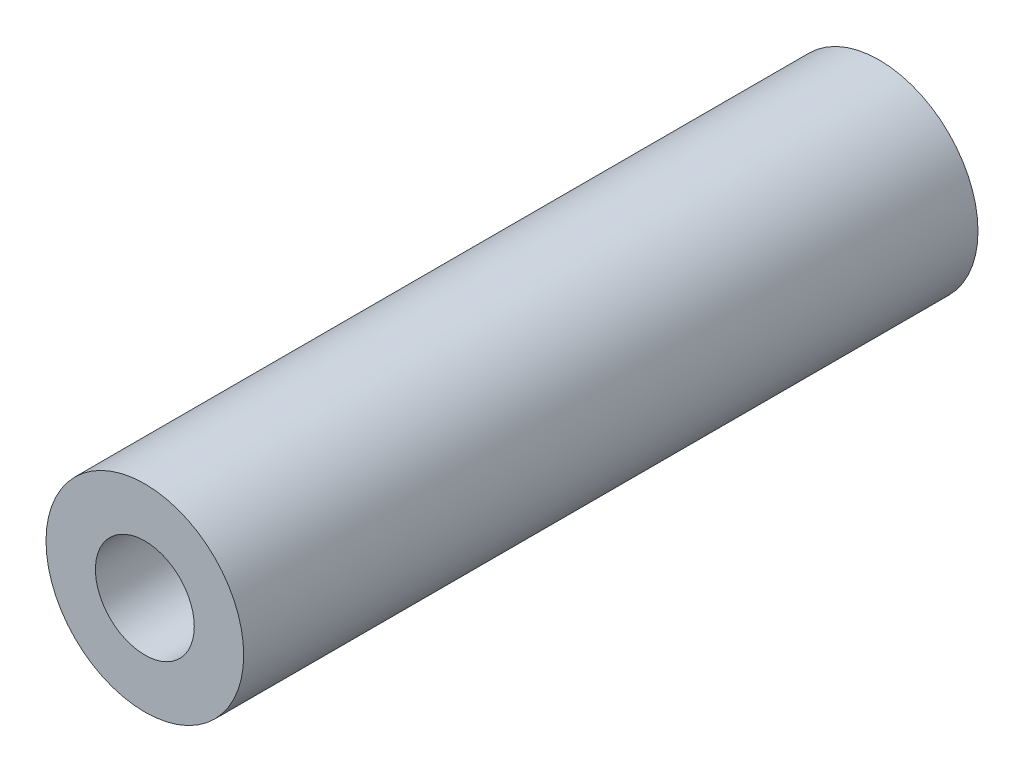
from build123d import *

# Parameters (mm, degrees)
ESQUISSE1_R      = 3.5
ESQUISSE1_R_2    = 1.75
EXTRUSION1_DEPTH = 26


with BuildPart() as part:
    # Esquisse1 → Extrusion1 (new body)
    with BuildSketch(Plane.XY):
        Circle(ESQUISSE1_R)
        Circle(ESQUISSE1_R_2, mode=Mode.SUBTRACT)
    extrude(amount=-EXTRUSION1_DEPTH)


solid = part.part
